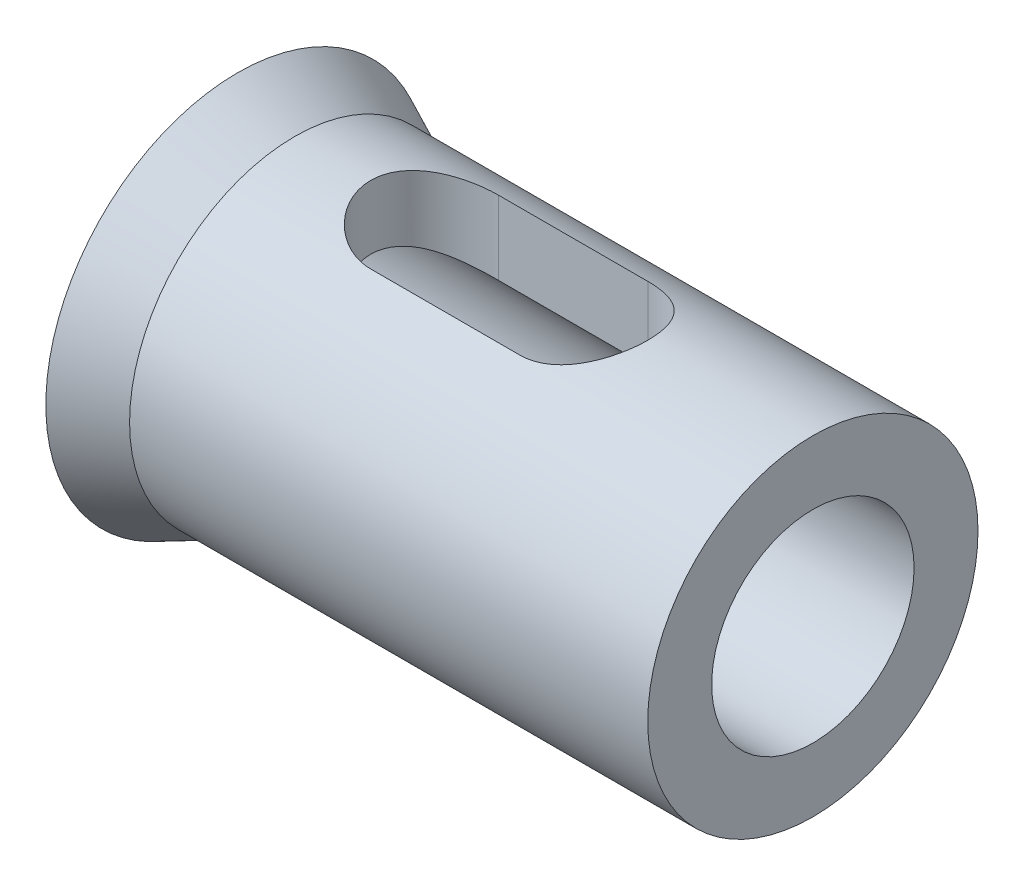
ISO-10303-21;
HEADER;
FILE_DESCRIPTION(('STEP AP214'),'2;1');
FILE_NAME('part.step','',(''),(''),'','','');
FILE_SCHEMA(('AUTOMOTIVE_DESIGN { 1 0 10303 214 1 1 1 1 }'));
ENDSEC;
DATA;
#1=APPLICATION_CONTEXT('core data for automotive mechanical design processes');
#2=APPLICATION_PROTOCOL_DEFINITION('international standard','automotive_design',2000,#1);
#3=PRODUCT_CONTEXT('',#1,'mechanical');
#4=PRODUCT('Part','Part','',(#3));
#5=PRODUCT_RELATED_PRODUCT_CATEGORY('part','',(#4));
#6=PRODUCT_DEFINITION_FORMATION('','',#4);
#7=PRODUCT_DEFINITION_CONTEXT('part definition',#1,'design');
#8=PRODUCT_DEFINITION('design','',#6,#7);
#9=PRODUCT_DEFINITION_SHAPE('','',#8);
#10=(LENGTH_UNIT() NAMED_UNIT(*) SI_UNIT(.MILLI.,.METRE.));
#11=(NAMED_UNIT(*) PLANE_ANGLE_UNIT() SI_UNIT($,.RADIAN.));
#12=(NAMED_UNIT(*) SI_UNIT($,.STERADIAN.) SOLID_ANGLE_UNIT());
#13=UNCERTAINTY_MEASURE_WITH_UNIT(LENGTH_MEASURE(1.E-05),#10,'distance_accuracy_value','');
#14=(GEOMETRIC_REPRESENTATION_CONTEXT(3) GLOBAL_UNCERTAINTY_ASSIGNED_CONTEXT((#13)) GLOBAL_UNIT_ASSIGNED_CONTEXT((#10,
#11,#12)) REPRESENTATION_CONTEXT('',''));
#15=CARTESIAN_POINT('',(0.,0.,0.));
#16=DIRECTION('',(0.,0.,1.));
#17=DIRECTION('',(1.,0.,0.));
#18=AXIS2_PLACEMENT_3D('',#15,#16,#17);
#19=CARTESIAN_POINT('',(0.,0.,0.));
#20=DIRECTION('',(-1.,0.,0.));
#21=DIRECTION('',(0.,-1.,0.));
#22=AXIS2_PLACEMENT_3D('',#19,#20,#21);
#23=PLANE('',#22);
#24=CARTESIAN_POINT('',(0.,0.,0.));
#25=DIRECTION('',(1.,0.,0.));
#26=DIRECTION('',(0.,0.,-1.));
#27=AXIS2_PLACEMENT_3D('',#24,#25,#26);
#28=CIRCLE('',#27,4.74999999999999);
#29=CARTESIAN_POINT('',(0.,0.,-4.74999999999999));
#30=VERTEX_POINT('',#29);
#31=EDGE_CURVE('E211',#30,#30,#28,.T.);
#32=ORIENTED_EDGE('',*,*,#31,.T.);
#33=EDGE_LOOP('',(#32));
#34=FACE_BOUND('',#33,.T.);
#35=CARTESIAN_POINT('',(0.,0.,0.));
#36=DIRECTION('',(1.,0.,0.));
#37=DIRECTION('',(0.,1.,0.));
#38=AXIS2_PLACEMENT_3D('',#35,#36,#37);
#39=CIRCLE('',#38,9.);
#40=CARTESIAN_POINT('',(0.,9.,0.));
#41=VERTEX_POINT('',#40);
#42=EDGE_CURVE('E201',#41,#41,#39,.T.);
#43=ORIENTED_EDGE('',*,*,#42,.F.);
#44=EDGE_LOOP('',(#43));
#45=FACE_BOUND('',#44,.T.);
#46=ADVANCED_FACE('F32',(#34,#45),#23,.T.);
#47=CARTESIAN_POINT('',(2.68063365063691,0.,0.));
#48=DIRECTION('',(-1.,0.,0.));
#49=DIRECTION('',(0.,-1.,0.));
#50=AXIS2_PLACEMENT_3D('',#47,#48,#49);
#51=CONICAL_SURFACE('',#50,7.75,0.436332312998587);
#52=ORIENTED_EDGE('',*,*,#42,.T.);
#53=EDGE_LOOP('',(#52));
#54=FACE_BOUND('',#53,.T.);
#55=CARTESIAN_POINT('',(2.68063365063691,0.,0.));
#56=DIRECTION('',(1.,0.,0.));
#57=DIRECTION('',(0.,1.,0.));
#58=AXIS2_PLACEMENT_3D('',#55,#56,#57);
#59=CIRCLE('',#58,7.75);
#60=CARTESIAN_POINT('',(2.68063365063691,7.75,0.));
#61=VERTEX_POINT('',#60);
#62=EDGE_CURVE('E203',#61,#61,#59,.T.);
#63=ORIENTED_EDGE('',*,*,#62,.F.);
#64=EDGE_LOOP('',(#63));
#65=FACE_BOUND('',#64,.T.);
#66=ADVANCED_FACE('F165',(#54,#65),#51,.T.);
#67=CARTESIAN_POINT('',(27.,0.,0.));
#68=DIRECTION('',(1.,0.,0.));
#69=DIRECTION('',(0.,1.,0.));
#70=AXIS2_PLACEMENT_3D('',#67,#68,#69);
#71=CYLINDRICAL_SURFACE('',#70,7.75);
#72=CARTESIAN_POINT('',(9.25,-7.14580296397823,3.));
#73=CARTESIAN_POINT('',(9.1690530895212,-7.14578711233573,3.00001172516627));
#74=CARTESIAN_POINT('',(9.08811485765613,-7.14717801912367,2.99672410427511));
#75=CARTESIAN_POINT('',(8.92688588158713,-7.15265499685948,2.98364174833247));
#76=CARTESIAN_POINT('',(8.84659491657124,-7.15674010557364,2.97384933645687));
#77=CARTESIAN_POINT('',(8.68752889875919,-7.16746726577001,2.94789730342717));
#78=CARTESIAN_POINT('',(8.60874931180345,-7.17409973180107,2.93176154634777));
#79=CARTESIAN_POINT('',(8.45297045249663,-7.18969677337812,2.89330068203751));
#80=CARTESIAN_POINT('',(8.37597127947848,-7.19866147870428,2.87097523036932));
#81=CARTESIAN_POINT('',(8.14857383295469,-7.2286349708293,2.79505390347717));
#82=CARTESIAN_POINT('',(8.00147634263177,-7.25274494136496,2.73246350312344));
#83=CARTESIAN_POINT('',(7.71981506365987,-7.3064865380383,2.58531598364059));
#84=CARTESIAN_POINT('',(7.58526246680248,-7.33612302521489,2.50073949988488));
#85=CARTESIAN_POINT('',(7.32538976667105,-7.39932344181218,2.30723702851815));
#86=CARTESIAN_POINT('',(7.2008220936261,-7.43300756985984,2.19733767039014));
#87=CARTESIAN_POINT('',(6.97135670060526,-7.49950850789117,1.95837690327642));
#88=CARTESIAN_POINT('',(6.86646289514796,-7.5323251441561,1.82931168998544));
#89=CARTESIAN_POINT('',(6.67558884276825,-7.59484377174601,1.5498575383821));
#90=CARTESIAN_POINT('',(6.59044201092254,-7.62438766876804,1.39886074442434));
#91=CARTESIAN_POINT('',(6.44707985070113,-7.67556878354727,1.08334243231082));
#92=CARTESIAN_POINT('',(6.38885391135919,-7.69720911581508,0.918826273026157));
#93=CARTESIAN_POINT('',(6.30366784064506,-7.72928758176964,0.588907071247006));
#94=CARTESIAN_POINT('',(6.2754014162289,-7.74019212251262,0.423887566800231));
#95=CARTESIAN_POINT('',(6.24674115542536,-7.75125001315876,0.0911081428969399));
#96=CARTESIAN_POINT('',(6.24633812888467,-7.75140690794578,-0.076650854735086));
#97=CARTESIAN_POINT('',(6.27267781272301,-7.74124192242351,-0.400742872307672));
#98=CARTESIAN_POINT('',(6.29799203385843,-7.7314714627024,-0.557212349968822));
#99=CARTESIAN_POINT('',(6.37263118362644,-7.70328262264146,-0.863479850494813));
#100=CARTESIAN_POINT('',(6.42195747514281,-7.68486375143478,-1.01327749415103));
#101=CARTESIAN_POINT('',(6.54383530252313,-7.6408482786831,-1.30460000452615));
#102=CARTESIAN_POINT('',(6.6167206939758,-7.61514919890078,-1.44596908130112));
#103=CARTESIAN_POINT('',(6.78334238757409,-7.55915001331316,-1.71482883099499));
#104=CARTESIAN_POINT('',(6.87708574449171,-7.5288483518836,-1.84231478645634));
#105=CARTESIAN_POINT('',(7.08954283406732,-7.46453092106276,-2.08816065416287));
#106=CARTESIAN_POINT('',(7.20944268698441,-7.43040135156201,-2.20546785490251));
#107=CARTESIAN_POINT('',(7.46737036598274,-7.36374473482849,-2.41873387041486));
#108=CARTESIAN_POINT('',(7.60540578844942,-7.33121836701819,-2.51468369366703));
#109=CARTESIAN_POINT('',(7.90031277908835,-7.27068953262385,-2.68476755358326));
#110=CARTESIAN_POINT('',(8.05757496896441,-7.24282360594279,-2.7582827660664));
#111=CARTESIAN_POINT('',(8.30181386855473,-7.20798301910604,-2.84753967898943));
#112=CARTESIAN_POINT('',(8.38459801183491,-7.19753079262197,-2.87378575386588));
#113=CARTESIAN_POINT('',(8.55239360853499,-7.17929066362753,-2.91905507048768));
#114=CARTESIAN_POINT('',(8.63740404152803,-7.17150156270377,-2.93808156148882));
#115=CARTESIAN_POINT('',(8.80996165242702,-7.15881729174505,-2.96886028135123));
#116=CARTESIAN_POINT('',(8.89752678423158,-7.15395655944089,-2.98052602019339));
#117=CARTESIAN_POINT('',(9.07339093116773,-7.1474394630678,-2.99610111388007));
#118=CARTESIAN_POINT('',(9.1616893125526,-7.14578057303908,-3.0000165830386));
#119=CARTESIAN_POINT('',(9.25,-7.14580296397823,-3.));
#120=B_SPLINE_CURVE_WITH_KNOTS('',3,(#72,#73,#74,#75,#76,#77,#78,#79,#80,#81,#82,#83,#84,#85,
#86,#87,#88,#89,#90,#91,#92,#93,#94,#95,#96,#97,#98,#99,#100,#101,#102,#103,#104,#105,#106,#107,
#108,#109,#110,#111,#112,#113,#114,#115,#116,#117,#118,#119),.UNSPECIFIED.,.F.,.F.,(4,2,2,2,2,2,
2,2,2,2,2,2,2,2,2,2,2,2,2,2,2,2,2,4),(0.,0.242747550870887,0.485408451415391,0.727165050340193,
0.968935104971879,1.45157424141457,1.93463991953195,2.44087663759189,2.9472139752,
3.4720959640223,3.99677089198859,4.49748738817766,4.99803873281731,5.47222896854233,
5.94644612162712,6.4277018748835,6.90912065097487,7.420326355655,7.93174687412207,
8.45621110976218,8.71832413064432,8.9803190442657,9.24533776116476,9.51014731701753),.UNSPECIFIED.);
#121=CARTESIAN_POINT('',(9.25,-7.14580296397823,3.));
#122=VERTEX_POINT('',#121);
#123=CARTESIAN_POINT('',(9.25,-7.14580296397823,-3.));
#124=VERTEX_POINT('',#123);
#125=EDGE_CURVE('E177',#122,#124,#120,.T.);
#126=ORIENTED_EDGE('',*,*,#125,.F.);
#127=DIRECTION('',(1.,0.,0.));
#128=VECTOR('',#127,1.);
#129=CARTESIAN_POINT('',(27.,-7.14580296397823,3.));
#130=LINE('',#129,#128);
#131=CARTESIAN_POINT('',(16.25,-7.14580296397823,3.));
#132=VERTEX_POINT('',#131);
#133=EDGE_CURVE('E155',#132,#122,#130,.F.);
#134=ORIENTED_EDGE('',*,*,#133,.F.);
#135=CARTESIAN_POINT('',(16.25,-7.14580296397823,-3.));
#136=CARTESIAN_POINT('',(16.3309469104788,-7.14578711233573,-3.00001172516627));
#137=CARTESIAN_POINT('',(16.4118851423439,-7.14717801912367,-2.99672410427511));
#138=CARTESIAN_POINT('',(16.5731141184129,-7.15265499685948,-2.98364174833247));
#139=CARTESIAN_POINT('',(16.6534050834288,-7.15674010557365,-2.97384933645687));
#140=CARTESIAN_POINT('',(16.8124711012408,-7.16746726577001,-2.94789730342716));
#141=CARTESIAN_POINT('',(16.8912506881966,-7.17409973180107,-2.93176154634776));
#142=CARTESIAN_POINT('',(17.0470295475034,-7.18969677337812,-2.89330068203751));
#143=CARTESIAN_POINT('',(17.1240287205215,-7.19866147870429,-2.87097523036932));
#144=CARTESIAN_POINT('',(17.3514261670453,-7.22863497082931,-2.79505390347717));
#145=CARTESIAN_POINT('',(17.4985236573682,-7.25274494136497,-2.73246350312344));
#146=CARTESIAN_POINT('',(17.7801849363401,-7.3064865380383,-2.58531598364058));
#147=CARTESIAN_POINT('',(17.9147375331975,-7.3361230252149,-2.50073949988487));
#148=CARTESIAN_POINT('',(18.1746102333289,-7.39932344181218,-2.30723702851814));
#149=CARTESIAN_POINT('',(18.2991779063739,-7.43300756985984,-2.19733767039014));
#150=CARTESIAN_POINT('',(18.5286432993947,-7.49950850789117,-1.95837690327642));
#151=CARTESIAN_POINT('',(18.633537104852,-7.5323251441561,-1.82931168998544));
#152=CARTESIAN_POINT('',(18.8244111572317,-7.59484377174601,-1.5498575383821));
#153=CARTESIAN_POINT('',(18.9095579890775,-7.62438766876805,-1.39886074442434));
#154=CARTESIAN_POINT('',(19.0529201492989,-7.67556878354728,-1.08334243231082));
#155=CARTESIAN_POINT('',(19.1111460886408,-7.69720911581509,-0.918826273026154));
#156=CARTESIAN_POINT('',(19.1963321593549,-7.72928758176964,-0.588907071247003));
#157=CARTESIAN_POINT('',(19.2245985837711,-7.74019212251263,-0.423887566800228));
#158=CARTESIAN_POINT('',(19.2532588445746,-7.75125001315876,-0.0911081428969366));
#159=CARTESIAN_POINT('',(19.2536618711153,-7.75140690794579,0.0766508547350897));
#160=CARTESIAN_POINT('',(19.227322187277,-7.74124192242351,0.400742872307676));
#161=CARTESIAN_POINT('',(19.2020079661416,-7.73147146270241,0.557212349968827));
#162=CARTESIAN_POINT('',(19.1273688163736,-7.70328262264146,0.863479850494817));
#163=CARTESIAN_POINT('',(19.0780425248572,-7.68486375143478,1.01327749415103));
#164=CARTESIAN_POINT('',(18.9561646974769,-7.6408482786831,1.30460000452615));
#165=CARTESIAN_POINT('',(18.8832793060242,-7.61514919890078,1.44596908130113));
#166=CARTESIAN_POINT('',(18.7166576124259,-7.55915001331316,1.71482883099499));
#167=CARTESIAN_POINT('',(18.6229142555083,-7.5288483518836,1.84231478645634));
#168=CARTESIAN_POINT('',(18.4104571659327,-7.46453092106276,2.08816065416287));
#169=CARTESIAN_POINT('',(18.2905573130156,-7.43040135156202,2.20546785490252));
#170=CARTESIAN_POINT('',(18.0326296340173,-7.36374473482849,2.41873387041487));
#171=CARTESIAN_POINT('',(17.8945942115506,-7.33121836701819,2.51468369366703));
#172=CARTESIAN_POINT('',(17.5996872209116,-7.27068953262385,2.68476755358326));
#173=CARTESIAN_POINT('',(17.4424250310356,-7.24282360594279,2.7582827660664));
#174=CARTESIAN_POINT('',(17.1981861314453,-7.20798301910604,2.84753967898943));
#175=CARTESIAN_POINT('',(17.1154019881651,-7.19753079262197,2.87378575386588));
#176=CARTESIAN_POINT('',(16.947606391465,-7.17929066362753,2.91905507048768));
#177=CARTESIAN_POINT('',(16.862595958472,-7.17150156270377,2.93808156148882));
#178=CARTESIAN_POINT('',(16.690038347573,-7.15881729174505,2.96886028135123));
#179=CARTESIAN_POINT('',(16.6024732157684,-7.15395655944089,2.98052602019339));
#180=CARTESIAN_POINT('',(16.4266090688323,-7.1474394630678,2.99610111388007));
#181=CARTESIAN_POINT('',(16.3383106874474,-7.14578057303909,3.0000165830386));
#182=CARTESIAN_POINT('',(16.25,-7.14580296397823,3.));
#183=B_SPLINE_CURVE_WITH_KNOTS('',3,(#135,#136,#137,#138,#139,#140,#141,#142,#143,#144,#145,
#146,#147,#148,#149,#150,#151,#152,#153,#154,#155,#156,#157,#158,#159,#160,#161,#162,#163,#164,
#165,#166,#167,#168,#169,#170,#171,#172,#173,#174,#175,#176,#177,#178,#179,#180,#181,#182),
.UNSPECIFIED.,.F.,.F.,(4,2,2,2,2,2,2,2,2,2,2,2,2,2,2,2,2,2,2,2,2,2,2,4),(0.,0.242747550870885,
0.485408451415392,0.727165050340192,0.968935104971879,1.45157424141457,1.93463991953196,
2.44087663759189,2.94721397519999,3.47209596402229,3.99677089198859,4.49748738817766,
4.99803873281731,5.47222896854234,5.94644612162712,6.4277018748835,6.90912065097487,
7.42032635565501,7.93174687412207,8.45621110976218,8.71832413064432,8.9803190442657,
9.24533776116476,9.51014731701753),.UNSPECIFIED.);
#184=CARTESIAN_POINT('',(16.25,-7.14580296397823,-3.));
#185=VERTEX_POINT('',#184);
#186=EDGE_CURVE('E114',#185,#132,#183,.T.);
#187=ORIENTED_EDGE('',*,*,#186,.F.);
#188=DIRECTION('',(1.,0.,0.));
#189=VECTOR('',#188,1.);
#190=CARTESIAN_POINT('',(27.,-7.14580296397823,-3.));
#191=LINE('',#190,#189);
#192=EDGE_CURVE('E223',#124,#185,#191,.T.);
#193=ORIENTED_EDGE('',*,*,#192,.F.);
#194=EDGE_LOOP('',(#126,#134,#187,#193));
#195=FACE_BOUND('',#194,.T.);
#196=CARTESIAN_POINT('',(9.25,7.14580296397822,-3.));
#197=CARTESIAN_POINT('',(9.1690530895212,7.14578711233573,-3.00001172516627));
#198=CARTESIAN_POINT('',(9.08811485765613,7.14717801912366,-2.99672410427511));
#199=CARTESIAN_POINT('',(8.92688588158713,7.15265499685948,-2.98364174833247));
#200=CARTESIAN_POINT('',(8.84659491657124,7.15674010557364,-2.97384933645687));
#201=CARTESIAN_POINT('',(8.68752889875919,7.16746726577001,-2.94789730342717));
#202=CARTESIAN_POINT('',(8.60874931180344,7.17409973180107,-2.93176154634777));
#203=CARTESIAN_POINT('',(8.45297045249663,7.18969677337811,-2.89330068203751));
#204=CARTESIAN_POINT('',(8.37597127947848,7.19866147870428,-2.87097523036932));
#205=CARTESIAN_POINT('',(8.14857383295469,7.2286349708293,-2.79505390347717));
#206=CARTESIAN_POINT('',(8.00147634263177,7.25274494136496,-2.73246350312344));
#207=CARTESIAN_POINT('',(7.71981506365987,7.3064865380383,-2.58531598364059));
#208=CARTESIAN_POINT('',(7.58526246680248,7.33612302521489,-2.50073949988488));
#209=CARTESIAN_POINT('',(7.32538976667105,7.39932344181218,-2.30723702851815));
#210=CARTESIAN_POINT('',(7.2008220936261,7.43300756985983,-2.19733767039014));
#211=CARTESIAN_POINT('',(6.97135670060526,7.49950850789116,-1.95837690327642));
#212=CARTESIAN_POINT('',(6.86646289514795,7.5323251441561,-1.82931168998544));
#213=CARTESIAN_POINT('',(6.67558884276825,7.59484377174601,-1.5498575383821));
#214=CARTESIAN_POINT('',(6.59044201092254,7.62438766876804,-1.39886074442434));
#215=CARTESIAN_POINT('',(6.44707985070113,7.67556878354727,-1.08334243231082));
#216=CARTESIAN_POINT('',(6.38885391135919,7.69720911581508,-0.918826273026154));
#217=CARTESIAN_POINT('',(6.30366784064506,7.72928758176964,-0.588907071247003));
#218=CARTESIAN_POINT('',(6.2754014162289,7.74019212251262,-0.423887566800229));
#219=CARTESIAN_POINT('',(6.24674115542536,7.75125001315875,-0.0911081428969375));
#220=CARTESIAN_POINT('',(6.24633812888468,7.75140690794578,0.0766508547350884));
#221=CARTESIAN_POINT('',(6.27267781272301,7.74124192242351,0.400742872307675));
#222=CARTESIAN_POINT('',(6.29799203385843,7.7314714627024,0.557212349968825));
#223=CARTESIAN_POINT('',(6.37263118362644,7.70328262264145,0.863479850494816));
#224=CARTESIAN_POINT('',(6.42195747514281,7.68486375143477,1.01327749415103));
#225=CARTESIAN_POINT('',(6.54383530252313,7.6408482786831,1.30460000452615));
#226=CARTESIAN_POINT('',(6.6167206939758,7.61514919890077,1.44596908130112));
#227=CARTESIAN_POINT('',(6.78334238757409,7.55915001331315,1.71482883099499));
#228=CARTESIAN_POINT('',(6.87708574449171,7.5288483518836,1.84231478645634));
#229=CARTESIAN_POINT('',(7.08954283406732,7.46453092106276,2.08816065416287));
#230=CARTESIAN_POINT('',(7.20944268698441,7.43040135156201,2.20546785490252));
#231=CARTESIAN_POINT('',(7.46737036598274,7.36374473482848,2.41873387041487));
#232=CARTESIAN_POINT('',(7.60540578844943,7.33121836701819,2.51468369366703));
#233=CARTESIAN_POINT('',(7.90031277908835,7.27068953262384,2.68476755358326));
#234=CARTESIAN_POINT('',(8.05757496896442,7.24282360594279,2.7582827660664));
#235=CARTESIAN_POINT('',(8.30181386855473,7.20798301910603,2.84753967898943));
#236=CARTESIAN_POINT('',(8.38459801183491,7.19753079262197,2.87378575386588));
#237=CARTESIAN_POINT('',(8.552393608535,7.17929066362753,2.91905507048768));
#238=CARTESIAN_POINT('',(8.63740404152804,7.17150156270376,2.93808156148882));
#239=CARTESIAN_POINT('',(8.80996165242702,7.15881729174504,2.96886028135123));
#240=CARTESIAN_POINT('',(8.89752678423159,7.15395655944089,2.98052602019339));
#241=CARTESIAN_POINT('',(9.07339093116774,7.1474394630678,2.99610111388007));
#242=CARTESIAN_POINT('',(9.1616893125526,7.14578057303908,3.0000165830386));
#243=CARTESIAN_POINT('',(9.25,7.14580296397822,3.));
#244=B_SPLINE_CURVE_WITH_KNOTS('',3,(#196,#197,#198,#199,#200,#201,#202,#203,#204,#205,#206,
#207,#208,#209,#210,#211,#212,#213,#214,#215,#216,#217,#218,#219,#220,#221,#222,#223,#224,#225,
#226,#227,#228,#229,#230,#231,#232,#233,#234,#235,#236,#237,#238,#239,#240,#241,#242,#243),
.UNSPECIFIED.,.F.,.F.,(4,2,2,2,2,2,2,2,2,2,2,2,2,2,2,2,2,2,2,2,2,2,2,4),(0.,0.242747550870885,
0.485408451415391,0.727165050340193,0.968935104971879,1.45157424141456,1.93463991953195,
2.44087663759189,2.9472139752,3.4720959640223,3.99677089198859,4.49748738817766,
4.99803873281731,5.47222896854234,5.94644612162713,6.4277018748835,6.90912065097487,
7.420326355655,7.93174687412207,8.45621110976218,8.71832413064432,8.9803190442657,
9.24533776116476,9.51014731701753),.UNSPECIFIED.);
#245=CARTESIAN_POINT('',(9.25,7.14580296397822,-3.));
#246=VERTEX_POINT('',#245);
#247=CARTESIAN_POINT('',(9.25,7.14580296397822,3.));
#248=VERTEX_POINT('',#247);
#249=EDGE_CURVE('E172',#246,#248,#244,.T.);
#250=ORIENTED_EDGE('',*,*,#249,.F.);
#251=DIRECTION('',(1.,0.,0.));
#252=VECTOR('',#251,1.);
#253=CARTESIAN_POINT('',(27.,7.14580296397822,-3.));
#254=LINE('',#253,#252);
#255=CARTESIAN_POINT('',(16.25,7.14580296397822,-3.));
#256=VERTEX_POINT('',#255);
#257=EDGE_CURVE('E178',#256,#246,#254,.F.);
#258=ORIENTED_EDGE('',*,*,#257,.F.);
#259=CARTESIAN_POINT('',(16.25,7.14580296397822,3.));
#260=CARTESIAN_POINT('',(16.3309469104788,7.14578711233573,3.00001172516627));
#261=CARTESIAN_POINT('',(16.4118851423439,7.14717801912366,2.99672410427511));
#262=CARTESIAN_POINT('',(16.5731141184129,7.15265499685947,2.98364174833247));
#263=CARTESIAN_POINT('',(16.6534050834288,7.15674010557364,2.97384933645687));
#264=CARTESIAN_POINT('',(16.8124711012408,7.16746726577,2.94789730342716));
#265=CARTESIAN_POINT('',(16.8912506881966,7.17409973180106,2.93176154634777));
#266=CARTESIAN_POINT('',(17.0470295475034,7.18969677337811,2.89330068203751));
#267=CARTESIAN_POINT('',(17.1240287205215,7.19866147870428,2.87097523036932));
#268=CARTESIAN_POINT('',(17.3514261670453,7.2286349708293,2.79505390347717));
#269=CARTESIAN_POINT('',(17.4985236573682,7.25274494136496,2.73246350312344));
#270=CARTESIAN_POINT('',(17.7801849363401,7.30648653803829,2.58531598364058));
#271=CARTESIAN_POINT('',(17.9147375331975,7.33612302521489,2.50073949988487));
#272=CARTESIAN_POINT('',(18.1746102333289,7.39932344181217,2.30723702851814));
#273=CARTESIAN_POINT('',(18.2991779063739,7.43300756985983,2.19733767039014));
#274=CARTESIAN_POINT('',(18.5286432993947,7.49950850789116,1.95837690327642));
#275=CARTESIAN_POINT('',(18.633537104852,7.53232514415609,1.82931168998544));
#276=CARTESIAN_POINT('',(18.8244111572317,7.594843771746,1.5498575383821));
#277=CARTESIAN_POINT('',(18.9095579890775,7.62438766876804,1.39886074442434));
#278=CARTESIAN_POINT('',(19.0529201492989,7.67556878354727,1.08334243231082));
#279=CARTESIAN_POINT('',(19.1111460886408,7.69720911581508,0.918826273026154));
#280=CARTESIAN_POINT('',(19.1963321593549,7.72928758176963,0.588907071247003));
#281=CARTESIAN_POINT('',(19.2245985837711,7.74019212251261,0.423887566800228));
#282=CARTESIAN_POINT('',(19.2532588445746,7.75125001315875,0.0911081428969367));
#283=CARTESIAN_POINT('',(19.2536618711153,7.75140690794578,-0.0766508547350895));
#284=CARTESIAN_POINT('',(19.227322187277,7.7412419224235,-0.400742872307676));
#285=CARTESIAN_POINT('',(19.2020079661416,7.73147146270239,-0.557212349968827));
#286=CARTESIAN_POINT('',(19.1273688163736,7.70328262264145,-0.863479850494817));
#287=CARTESIAN_POINT('',(19.0780425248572,7.68486375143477,-1.01327749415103));
#288=CARTESIAN_POINT('',(18.9561646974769,7.64084827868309,-1.30460000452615));
#289=CARTESIAN_POINT('',(18.8832793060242,7.61514919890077,-1.44596908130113));
#290=CARTESIAN_POINT('',(18.7166576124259,7.55915001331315,-1.71482883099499));
#291=CARTESIAN_POINT('',(18.6229142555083,7.52884835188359,-1.84231478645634));
#292=CARTESIAN_POINT('',(18.4104571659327,7.46453092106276,-2.08816065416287));
#293=CARTESIAN_POINT('',(18.2905573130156,7.43040135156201,-2.20546785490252));
#294=CARTESIAN_POINT('',(18.0326296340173,7.36374473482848,-2.41873387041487));
#295=CARTESIAN_POINT('',(17.8945942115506,7.33121836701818,-2.51468369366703));
#296=CARTESIAN_POINT('',(17.5996872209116,7.27068953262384,-2.68476755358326));
#297=CARTESIAN_POINT('',(17.4424250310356,7.24282360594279,-2.7582827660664));
#298=CARTESIAN_POINT('',(17.1981861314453,7.20798301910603,-2.84753967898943));
#299=CARTESIAN_POINT('',(17.1154019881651,7.19753079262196,-2.87378575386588));
#300=CARTESIAN_POINT('',(16.947606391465,7.17929066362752,-2.91905507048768));
#301=CARTESIAN_POINT('',(16.862595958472,7.17150156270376,-2.93808156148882));
#302=CARTESIAN_POINT('',(16.690038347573,7.15881729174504,-2.96886028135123));
#303=CARTESIAN_POINT('',(16.6024732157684,7.15395655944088,-2.98052602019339));
#304=CARTESIAN_POINT('',(16.4266090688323,7.14743946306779,-2.99610111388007));
#305=CARTESIAN_POINT('',(16.3383106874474,7.14578057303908,-3.0000165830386));
#306=CARTESIAN_POINT('',(16.25,7.14580296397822,-3.));
#307=B_SPLINE_CURVE_WITH_KNOTS('',3,(#259,#260,#261,#262,#263,#264,#265,#266,#267,#268,#269,
#270,#271,#272,#273,#274,#275,#276,#277,#278,#279,#280,#281,#282,#283,#284,#285,#286,#287,#288,
#289,#290,#291,#292,#293,#294,#295,#296,#297,#298,#299,#300,#301,#302,#303,#304,#305,#306),
.UNSPECIFIED.,.F.,.F.,(4,2,2,2,2,2,2,2,2,2,2,2,2,2,2,2,2,2,2,2,2,2,2,4),(0.,0.242747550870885,
0.485408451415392,0.727165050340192,0.968935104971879,1.45157424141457,1.93463991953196,
2.44087663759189,2.94721397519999,3.47209596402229,3.99677089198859,4.49748738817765,
4.99803873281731,5.47222896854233,5.94644612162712,6.42770187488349,6.90912065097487,
7.42032635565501,7.93174687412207,8.45621110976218,8.71832413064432,8.9803190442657,
9.24533776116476,9.51014731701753),.UNSPECIFIED.);
#308=CARTESIAN_POINT('',(16.25,7.14580296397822,3.));
#309=VERTEX_POINT('',#308);
#310=EDGE_CURVE('E149',#309,#256,#307,.T.);
#311=ORIENTED_EDGE('',*,*,#310,.F.);
#312=DIRECTION('',(1.,0.,0.));
#313=VECTOR('',#312,1.);
#314=CARTESIAN_POINT('',(27.,7.14580296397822,3.));
#315=LINE('',#314,#313);
#316=EDGE_CURVE('E224',#248,#309,#315,.T.);
#317=ORIENTED_EDGE('',*,*,#316,.F.);
#318=EDGE_LOOP('',(#250,#258,#311,#317));
#319=FACE_BOUND('',#318,.T.);
#320=ORIENTED_EDGE('',*,*,#62,.T.);
#321=EDGE_LOOP('',(#320));
#322=FACE_BOUND('',#321,.T.);
#323=CARTESIAN_POINT('',(27.,0.,0.));
#324=DIRECTION('',(1.,0.,0.));
#325=DIRECTION('',(0.,1.,0.));
#326=AXIS2_PLACEMENT_3D('',#323,#324,#325);
#327=CIRCLE('',#326,7.75);
#328=CARTESIAN_POINT('',(27.,7.74999999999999,0.));
#329=VERTEX_POINT('',#328);
#330=EDGE_CURVE('E208',#329,#329,#327,.T.);
#331=ORIENTED_EDGE('',*,*,#330,.F.);
#332=EDGE_LOOP('',(#331));
#333=FACE_BOUND('',#332,.T.);
#334=ADVANCED_FACE('F161',(#195,#319,#322,#333),#71,.T.);
#335=CARTESIAN_POINT('',(27.,7.74999999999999,0.));
#336=DIRECTION('',(1.,0.,0.));
#337=DIRECTION('',(0.,1.,0.));
#338=AXIS2_PLACEMENT_3D('',#335,#336,#337);
#339=PLANE('',#338);
#340=CARTESIAN_POINT('',(27.,0.,0.));
#341=DIRECTION('',(1.,0.,0.));
#342=DIRECTION('',(0.,0.,-1.));
#343=AXIS2_PLACEMENT_3D('',#340,#341,#342);
#344=CIRCLE('',#343,4.74999999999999);
#345=CARTESIAN_POINT('',(27.,0.,-4.74999999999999));
#346=VERTEX_POINT('',#345);
#347=EDGE_CURVE('E213',#346,#346,#344,.T.);
#348=ORIENTED_EDGE('',*,*,#347,.F.);
#349=EDGE_LOOP('',(#348));
#350=FACE_BOUND('',#349,.T.);
#351=ORIENTED_EDGE('',*,*,#330,.T.);
#352=EDGE_LOOP('',(#351));
#353=FACE_BOUND('',#352,.T.);
#354=ADVANCED_FACE('F164',(#350,#353),#339,.T.);
#355=CARTESIAN_POINT('',(27.,0.,0.));
#356=DIRECTION('',(1.,0.,0.));
#357=DIRECTION('',(0.,0.,-1.));
#358=AXIS2_PLACEMENT_3D('',#355,#356,#357);
#359=CYLINDRICAL_SURFACE('',#358,4.74999999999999);
#360=DIRECTION('',(1.,0.,0.));
#361=VECTOR('',#360,1.);
#362=CARTESIAN_POINT('',(27.,-3.68272996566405,3.));
#363=LINE('',#362,#361);
#364=CARTESIAN_POINT('',(16.25,-3.68272996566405,3.));
#365=VERTEX_POINT('',#364);
#366=CARTESIAN_POINT('',(9.25,-3.68272996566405,3.));
#367=VERTEX_POINT('',#366);
#368=EDGE_CURVE('E99',#365,#367,#363,.F.);
#369=ORIENTED_EDGE('',*,*,#368,.T.);
#370=CARTESIAN_POINT('',(9.25,-3.68272996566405,3.));
#371=CARTESIAN_POINT('',(9.175100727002,-3.68269415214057,3.00001795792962));
#372=CARTESIAN_POINT('',(9.10022302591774,-3.68501397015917,2.9971958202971));
#373=CARTESIAN_POINT('',(8.95123516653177,-3.6940909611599,2.98601488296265));
#374=CARTESIAN_POINT('',(8.87712423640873,-3.70084311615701,2.97766234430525));
#375=CARTESIAN_POINT('',(8.73087170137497,-3.7184338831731,2.95566126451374));
#376=CARTESIAN_POINT('',(8.65871847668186,-3.72923582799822,2.94206021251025));
#377=CARTESIAN_POINT('',(8.51620781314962,-3.7544678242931,2.90979245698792));
#378=CARTESIAN_POINT('',(8.44585080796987,-3.76889874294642,2.8911245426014));
#379=CARTESIAN_POINT('',(8.23871299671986,-3.81670499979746,2.82808037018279));
#380=CARTESIAN_POINT('',(8.10510650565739,-3.85469461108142,2.77654572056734));
#381=CARTESIAN_POINT('',(7.84835987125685,-3.93856100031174,2.65624057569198));
#382=CARTESIAN_POINT('',(7.72524726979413,-3.98445763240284,2.58742648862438));
#383=CARTESIAN_POINT('',(7.47479940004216,-4.08644565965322,2.42362789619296));
#384=CARTESIAN_POINT('',(7.34917405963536,-4.14307407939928,2.32635519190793));
#385=CARTESIAN_POINT('',(7.11463729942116,-4.25578410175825,2.11314717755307));
#386=CARTESIAN_POINT('',(7.00573234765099,-4.31186548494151,1.99720468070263));
#387=CARTESIAN_POINT('',(6.79414410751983,-4.42547108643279,1.73230054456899));
#388=CARTESIAN_POINT('',(6.6939203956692,-4.4823068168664,1.58102554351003));
#389=CARTESIAN_POINT('',(6.56440516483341,-4.55781890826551,1.34012105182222));
#390=CARTESIAN_POINT('',(6.52469411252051,-4.58137199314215,1.25745888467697));
#391=CARTESIAN_POINT('',(6.45272711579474,-4.62454329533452,1.08798856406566));
#392=CARTESIAN_POINT('',(6.42046595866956,-4.64416426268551,1.00118336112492));
#393=CARTESIAN_POINT('',(6.36683102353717,-4.67704649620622,0.833241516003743));
#394=CARTESIAN_POINT('',(6.34467879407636,-4.6907542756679,0.752439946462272));
#395=CARTESIAN_POINT('',(6.30713995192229,-4.71409681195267,0.588744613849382));
#396=CARTESIAN_POINT('',(6.29174939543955,-4.72373394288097,0.505852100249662));
#397=CARTESIAN_POINT('',(6.26799051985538,-4.73864894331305,0.33872479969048));
#398=CARTESIAN_POINT('',(6.259617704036,-4.74392960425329,0.254490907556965));
#399=CARTESIAN_POINT('',(6.25002202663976,-4.74998508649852,0.0854853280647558));
#400=CARTESIAN_POINT('',(6.24879831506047,-4.75076044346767,0.000713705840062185));
#401=CARTESIAN_POINT('',(6.25527267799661,-4.74666756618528,-0.229936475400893));
#402=CARTESIAN_POINT('',(6.27007192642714,-4.73730672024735,-0.375619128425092));
#403=CARTESIAN_POINT('',(6.32030382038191,-4.70587382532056,-0.661849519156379));
#404=CARTESIAN_POINT('',(6.35573808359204,-4.68380077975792,-0.802396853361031));
#405=CARTESIAN_POINT('',(6.44562098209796,-4.6287986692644,-1.07523238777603));
#406=CARTESIAN_POINT('',(6.50010116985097,-4.59585159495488,-1.20750645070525));
#407=CARTESIAN_POINT('',(6.62602680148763,-4.52163164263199,-1.46110731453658));
#408=CARTESIAN_POINT('',(6.69747495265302,-4.48035743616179,-1.58243236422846));
#409=CARTESIAN_POINT('',(6.8653468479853,-4.38675351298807,-1.82705146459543));
#410=CARTESIAN_POINT('',(6.96377960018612,-4.3336864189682,-1.94868214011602));
#411=CARTESIAN_POINT('',(7.1776882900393,-4.22474814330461,-2.17481127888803));
#412=CARTESIAN_POINT('',(7.29319564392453,-4.16887192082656,-2.27927739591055));
#413=CARTESIAN_POINT('',(7.5562600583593,-4.05160444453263,-2.48244300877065));
#414=CARTESIAN_POINT('',(7.70603907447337,-3.9904913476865,-2.57844472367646));
#415=CARTESIAN_POINT('',(8.02306361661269,-3.87893493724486,-2.74340924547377));
#416=CARTESIAN_POINT('',(8.1902387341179,-3.82845093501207,-2.81247605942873));
#417=CARTESIAN_POINT('',(8.43440447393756,-3.77134154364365,-2.88794369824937));
#418=CARTESIAN_POINT('',(8.50569077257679,-3.75651977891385,-2.90714700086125));
#419=CARTESIAN_POINT('',(8.6501265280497,-3.73059095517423,-2.94034587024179));
#420=CARTESIAN_POINT('',(8.72327523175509,-3.71948241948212,-2.95434350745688));
#421=CARTESIAN_POINT('',(8.87159890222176,-3.70138361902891,-2.97699255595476));
#422=CARTESIAN_POINT('',(8.94678627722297,-3.69443191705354,-2.98559394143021));
#423=CARTESIAN_POINT('',(9.0979739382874,-3.6850831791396,-2.99711086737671));
#424=CARTESIAN_POINT('',(9.17397517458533,-3.68269222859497,-3.00001881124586));
#425=CARTESIAN_POINT('',(9.25,-3.68272996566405,-3.));
#426=B_SPLINE_CURVE_WITH_KNOTS('',3,(#370,#371,#372,#373,#374,#375,#376,#377,#378,#379,#380,
#381,#382,#383,#384,#385,#386,#387,#388,#389,#390,#391,#392,#393,#394,#395,#396,#397,#398,#399,
#400,#401,#402,#403,#404,#405,#406,#407,#408,#409,#410,#411,#412,#413,#414,#415,#416,#417,#418,
#419,#420,#421,#422,#423,#424,#425),.UNSPECIFIED.,.F.,.F.,(4,2,2,2,2,2,2,2,2,2,2,2,2,2,2,2,2,2,
2,2,2,2,2,2,2,2,2,4),(0.,0.224573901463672,0.448893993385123,0.671230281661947,
0.893619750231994,1.33610452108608,1.77971698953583,2.2837685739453,2.78801465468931,
3.35499285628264,3.63866342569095,3.92213490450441,4.17645487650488,4.4306263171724,
4.68463476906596,4.93861301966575,5.37648008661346,5.81438148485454,6.25301179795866,
6.69171214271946,7.18546298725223,7.68013387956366,8.24180915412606,8.80129356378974,
9.02696145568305,9.25253949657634,9.48017899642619,9.70812202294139),.UNSPECIFIED.);
#427=CARTESIAN_POINT('',(9.25,-3.68272996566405,-3.));
#428=VERTEX_POINT('',#427);
#429=EDGE_CURVE('E11',#367,#428,#426,.T.);
#430=ORIENTED_EDGE('',*,*,#429,.T.);
#431=DIRECTION('',(1.,0.,0.));
#432=VECTOR('',#431,1.);
#433=CARTESIAN_POINT('',(27.,-3.68272996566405,-3.));
#434=LINE('',#433,#432);
#435=CARTESIAN_POINT('',(16.25,-3.68272996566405,-3.));
#436=VERTEX_POINT('',#435);
#437=EDGE_CURVE('E44',#428,#436,#434,.T.);
#438=ORIENTED_EDGE('',*,*,#437,.T.);
#439=CARTESIAN_POINT('',(16.25,-3.68272996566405,-3.));
#440=CARTESIAN_POINT('',(16.324899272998,-3.68269415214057,-3.00001795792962));
#441=CARTESIAN_POINT('',(16.3997769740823,-3.68501397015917,-2.9971958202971));
#442=CARTESIAN_POINT('',(16.5487648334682,-3.6940909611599,-2.98601488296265));
#443=CARTESIAN_POINT('',(16.6228757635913,-3.70084311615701,-2.97766234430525));
#444=CARTESIAN_POINT('',(16.769128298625,-3.7184338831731,-2.95566126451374));
#445=CARTESIAN_POINT('',(16.8412815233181,-3.72923582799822,-2.94206021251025));
#446=CARTESIAN_POINT('',(16.9837921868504,-3.7544678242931,-2.90979245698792));
#447=CARTESIAN_POINT('',(17.0541491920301,-3.76889874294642,-2.8911245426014));
#448=CARTESIAN_POINT('',(17.2612870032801,-3.81670499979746,-2.82808037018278));
#449=CARTESIAN_POINT('',(17.3948934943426,-3.85469461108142,-2.77654572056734));
#450=CARTESIAN_POINT('',(17.6516401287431,-3.93856100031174,-2.65624057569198));
#451=CARTESIAN_POINT('',(17.7747527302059,-3.98445763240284,-2.58742648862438));
#452=CARTESIAN_POINT('',(18.0252005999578,-4.08644565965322,-2.42362789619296));
#453=CARTESIAN_POINT('',(18.1508259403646,-4.14307407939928,-2.32635519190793));
#454=CARTESIAN_POINT('',(18.3853627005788,-4.25578410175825,-2.11314717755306));
#455=CARTESIAN_POINT('',(18.494267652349,-4.31186548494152,-1.99720468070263));
#456=CARTESIAN_POINT('',(18.7058558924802,-4.42547108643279,-1.73230054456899));
#457=CARTESIAN_POINT('',(18.8060796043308,-4.4823068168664,-1.58102554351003));
#458=CARTESIAN_POINT('',(18.9355948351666,-4.55781890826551,-1.34012105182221));
#459=CARTESIAN_POINT('',(18.9753058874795,-4.58137199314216,-1.25745888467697));
#460=CARTESIAN_POINT('',(19.0472728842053,-4.62454329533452,-1.08798856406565));
#461=CARTESIAN_POINT('',(19.0795340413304,-4.64416426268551,-1.00118336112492));
#462=CARTESIAN_POINT('',(19.1331689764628,-4.67704649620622,-0.833241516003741));
#463=CARTESIAN_POINT('',(19.1553212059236,-4.6907542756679,-0.75243994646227));
#464=CARTESIAN_POINT('',(19.1928600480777,-4.71409681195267,-0.588744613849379));
#465=CARTESIAN_POINT('',(19.2082506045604,-4.72373394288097,-0.505852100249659));
#466=CARTESIAN_POINT('',(19.2320094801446,-4.73864894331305,-0.338724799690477));
#467=CARTESIAN_POINT('',(19.240382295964,-4.74392960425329,-0.254490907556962));
#468=CARTESIAN_POINT('',(19.2499779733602,-4.74998508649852,-0.085485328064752));
#469=CARTESIAN_POINT('',(19.2512016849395,-4.75076044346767,-0.000713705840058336));
#470=CARTESIAN_POINT('',(19.2447273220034,-4.74666756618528,0.229936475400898));
#471=CARTESIAN_POINT('',(19.2299280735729,-4.73730672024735,0.375619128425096));
#472=CARTESIAN_POINT('',(19.1796961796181,-4.70587382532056,0.661849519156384));
#473=CARTESIAN_POINT('',(19.144261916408,-4.68380077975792,0.802396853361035));
#474=CARTESIAN_POINT('',(19.054379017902,-4.6287986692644,1.07523238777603));
#475=CARTESIAN_POINT('',(18.999898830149,-4.59585159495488,1.20750645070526));
#476=CARTESIAN_POINT('',(18.8739731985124,-4.52163164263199,1.46110731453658));
#477=CARTESIAN_POINT('',(18.802525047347,-4.48035743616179,1.58243236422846));
#478=CARTESIAN_POINT('',(18.6346531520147,-4.38675351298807,1.82705146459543));
#479=CARTESIAN_POINT('',(18.5362203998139,-4.3336864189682,1.94868214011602));
#480=CARTESIAN_POINT('',(18.3223117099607,-4.22474814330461,2.17481127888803));
#481=CARTESIAN_POINT('',(18.2068043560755,-4.16887192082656,2.27927739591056));
#482=CARTESIAN_POINT('',(17.9437399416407,-4.05160444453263,2.48244300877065));
#483=CARTESIAN_POINT('',(17.7939609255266,-3.9904913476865,2.57844472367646));
#484=CARTESIAN_POINT('',(17.4769363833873,-3.87893493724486,2.74340924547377));
#485=CARTESIAN_POINT('',(17.3097612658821,-3.82845093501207,2.81247605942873));
#486=CARTESIAN_POINT('',(17.0655955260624,-3.77134154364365,2.88794369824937));
#487=CARTESIAN_POINT('',(16.9943092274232,-3.75651977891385,2.90714700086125));
#488=CARTESIAN_POINT('',(16.8498734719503,-3.73059095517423,2.94034587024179));
#489=CARTESIAN_POINT('',(16.7767247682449,-3.71948241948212,2.95434350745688));
#490=CARTESIAN_POINT('',(16.6284010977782,-3.70138361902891,2.97699255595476));
#491=CARTESIAN_POINT('',(16.553213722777,-3.69443191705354,2.98559394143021));
#492=CARTESIAN_POINT('',(16.4020260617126,-3.6850831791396,2.99711086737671));
#493=CARTESIAN_POINT('',(16.3260248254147,-3.68269222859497,3.00001881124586));
#494=CARTESIAN_POINT('',(16.25,-3.68272996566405,3.));
#495=B_SPLINE_CURVE_WITH_KNOTS('',3,(#439,#440,#441,#442,#443,#444,#445,#446,#447,#448,#449,
#450,#451,#452,#453,#454,#455,#456,#457,#458,#459,#460,#461,#462,#463,#464,#465,#466,#467,#468,
#469,#470,#471,#472,#473,#474,#475,#476,#477,#478,#479,#480,#481,#482,#483,#484,#485,#486,#487,
#488,#489,#490,#491,#492,#493,#494),.UNSPECIFIED.,.F.,.F.,(4,2,2,2,2,2,2,2,2,2,2,2,2,2,2,2,2,2,
2,2,2,2,2,2,2,2,2,4),(0.,0.224573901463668,0.448893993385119,0.671230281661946,
0.893619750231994,1.33610452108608,1.77971698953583,2.2837685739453,2.78801465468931,
3.35499285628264,3.63866342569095,3.92213490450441,4.17645487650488,4.4306263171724,
4.68463476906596,4.93861301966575,5.37648008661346,5.81438148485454,6.25301179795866,
6.69171214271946,7.18546298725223,7.68013387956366,8.24180915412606,8.80129356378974,
9.02696145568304,9.25253949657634,9.48017899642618,9.70812202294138),.UNSPECIFIED.);
#496=EDGE_CURVE('E106',#436,#365,#495,.T.);
#497=ORIENTED_EDGE('',*,*,#496,.T.);
#498=EDGE_LOOP('',(#369,#430,#438,#497));
#499=FACE_BOUND('',#498,.T.);
#500=DIRECTION('',(1.,0.,0.));
#501=VECTOR('',#500,1.);
#502=CARTESIAN_POINT('',(27.,3.68272996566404,-3.));
#503=LINE('',#502,#501);
#504=CARTESIAN_POINT('',(16.25,3.68272996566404,-3.));
#505=VERTEX_POINT('',#504);
#506=CARTESIAN_POINT('',(9.25,3.68272996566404,-3.));
#507=VERTEX_POINT('',#506);
#508=EDGE_CURVE('E195',#505,#507,#503,.F.);
#509=ORIENTED_EDGE('',*,*,#508,.T.);
#510=CARTESIAN_POINT('',(9.25,3.68272996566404,-3.));
#511=CARTESIAN_POINT('',(9.175100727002,3.68269415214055,-3.00001795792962));
#512=CARTESIAN_POINT('',(9.10022302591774,3.68501397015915,-2.9971958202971));
#513=CARTESIAN_POINT('',(8.95123516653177,3.69409096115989,-2.98601488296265));
#514=CARTESIAN_POINT('',(8.87712423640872,3.70084311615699,-2.97766234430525));
#515=CARTESIAN_POINT('',(8.73087170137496,3.71843388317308,-2.95566126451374));
#516=CARTESIAN_POINT('',(8.65871847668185,3.7292358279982,-2.94206021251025));
#517=CARTESIAN_POINT('',(8.51620781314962,3.75446782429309,-2.90979245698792));
#518=CARTESIAN_POINT('',(8.44585080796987,3.76889874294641,-2.8911245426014));
#519=CARTESIAN_POINT('',(8.23871299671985,3.81670499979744,-2.82808037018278));
#520=CARTESIAN_POINT('',(8.10510650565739,3.85469461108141,-2.77654572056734));
#521=CARTESIAN_POINT('',(7.84835987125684,3.93856100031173,-2.65624057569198));
#522=CARTESIAN_POINT('',(7.72524726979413,3.98445763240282,-2.58742648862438));
#523=CARTESIAN_POINT('',(7.47479940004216,4.0864456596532,-2.42362789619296));
#524=CARTESIAN_POINT('',(7.34917405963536,4.14307407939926,-2.32635519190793));
#525=CARTESIAN_POINT('',(7.11463729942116,4.25578410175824,-2.11314717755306));
#526=CARTESIAN_POINT('',(7.00573234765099,4.3118654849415,-1.99720468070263));
#527=CARTESIAN_POINT('',(6.79414410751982,4.42547108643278,-1.73230054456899));
#528=CARTESIAN_POINT('',(6.6939203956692,4.48230681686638,-1.58102554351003));
#529=CARTESIAN_POINT('',(6.56440516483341,4.55781890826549,-1.34012105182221));
#530=CARTESIAN_POINT('',(6.52469411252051,4.58137199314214,-1.25745888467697));
#531=CARTESIAN_POINT('',(6.45272711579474,4.62454329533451,-1.08798856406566));
#532=CARTESIAN_POINT('',(6.42046595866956,4.6441642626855,-1.00118336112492));
#533=CARTESIAN_POINT('',(6.36683102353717,4.6770464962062,-0.833241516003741));
#534=CARTESIAN_POINT('',(6.34467879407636,4.69075427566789,-0.752439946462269));
#535=CARTESIAN_POINT('',(6.30713995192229,4.71409681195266,-0.58874461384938));
#536=CARTESIAN_POINT('',(6.29174939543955,4.72373394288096,-0.505852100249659));
#537=CARTESIAN_POINT('',(6.26799051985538,4.73864894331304,-0.338724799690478));
#538=CARTESIAN_POINT('',(6.259617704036,4.74392960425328,-0.254490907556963));
#539=CARTESIAN_POINT('',(6.25002202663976,4.74998508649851,-0.0854853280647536));
#540=CARTESIAN_POINT('',(6.24879831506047,4.75076044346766,-0.000713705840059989));
#541=CARTESIAN_POINT('',(6.25527267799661,4.74666756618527,0.229936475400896));
#542=CARTESIAN_POINT('',(6.27007192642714,4.73730672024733,0.375619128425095));
#543=CARTESIAN_POINT('',(6.32030382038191,4.70587382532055,0.661849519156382));
#544=CARTESIAN_POINT('',(6.35573808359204,4.68380077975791,0.802396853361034));
#545=CARTESIAN_POINT('',(6.44562098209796,4.62879866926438,1.07523238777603));
#546=CARTESIAN_POINT('',(6.50010116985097,4.59585159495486,1.20750645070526));
#547=CARTESIAN_POINT('',(6.62602680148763,4.52163164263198,1.46110731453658));
#548=CARTESIAN_POINT('',(6.69747495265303,4.48035743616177,1.58243236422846));
#549=CARTESIAN_POINT('',(6.8653468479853,4.38675351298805,1.82705146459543));
#550=CARTESIAN_POINT('',(6.96377960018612,4.33368641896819,1.94868214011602));
#551=CARTESIAN_POINT('',(7.1776882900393,4.2247481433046,2.17481127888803));
#552=CARTESIAN_POINT('',(7.29319564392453,4.16887192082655,2.27927739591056));
#553=CARTESIAN_POINT('',(7.55626005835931,4.05160444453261,2.48244300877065));
#554=CARTESIAN_POINT('',(7.70603907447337,3.99049134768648,2.57844472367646));
#555=CARTESIAN_POINT('',(8.0230636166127,3.87893493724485,2.74340924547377));
#556=CARTESIAN_POINT('',(8.1902387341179,3.82845093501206,2.81247605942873));
#557=CARTESIAN_POINT('',(8.43440447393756,3.77134154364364,2.88794369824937));
#558=CARTESIAN_POINT('',(8.50569077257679,3.75651977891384,2.90714700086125));
#559=CARTESIAN_POINT('',(8.65012652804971,3.73059095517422,2.94034587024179));
#560=CARTESIAN_POINT('',(8.72327523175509,3.71948241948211,2.95434350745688));
#561=CARTESIAN_POINT('',(8.87159890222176,3.7013836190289,2.97699255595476));
#562=CARTESIAN_POINT('',(8.94678627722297,3.69443191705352,2.98559394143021));
#563=CARTESIAN_POINT('',(9.0979739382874,3.68508317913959,2.99711086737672));
#564=CARTESIAN_POINT('',(9.17397517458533,3.68269222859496,3.00001881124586));
#565=CARTESIAN_POINT('',(9.25,3.68272996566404,3.));
#566=B_SPLINE_CURVE_WITH_KNOTS('',3,(#510,#511,#512,#513,#514,#515,#516,#517,#518,#519,#520,
#521,#522,#523,#524,#525,#526,#527,#528,#529,#530,#531,#532,#533,#534,#535,#536,#537,#538,#539,
#540,#541,#542,#543,#544,#545,#546,#547,#548,#549,#550,#551,#552,#553,#554,#555,#556,#557,#558,
#559,#560,#561,#562,#563,#564,#565),.UNSPECIFIED.,.F.,.F.,(4,2,2,2,2,2,2,2,2,2,2,2,2,2,2,2,2,2,
2,2,2,2,2,2,2,2,2,4),(0.,0.22457390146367,0.448893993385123,0.671230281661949,0.893619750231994,
1.33610452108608,1.77971698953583,2.2837685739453,2.78801465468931,3.35499285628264,
3.63866342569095,3.92213490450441,4.17645487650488,4.4306263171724,4.68463476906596,
4.93861301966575,5.37648008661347,5.81438148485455,6.25301179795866,6.69171214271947,
7.18546298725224,7.68013387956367,8.24180915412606,8.80129356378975,9.02696145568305,
9.25253949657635,9.48017899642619,9.70812202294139),.UNSPECIFIED.);
#567=CARTESIAN_POINT('',(9.25,3.68272996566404,3.));
#568=VERTEX_POINT('',#567);
#569=EDGE_CURVE('E107',#507,#568,#566,.T.);
#570=ORIENTED_EDGE('',*,*,#569,.T.);
#571=DIRECTION('',(1.,0.,0.));
#572=VECTOR('',#571,1.);
#573=CARTESIAN_POINT('',(27.,3.68272996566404,3.));
#574=LINE('',#573,#572);
#575=CARTESIAN_POINT('',(16.25,3.68272996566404,3.));
#576=VERTEX_POINT('',#575);
#577=EDGE_CURVE('E198',#568,#576,#574,.T.);
#578=ORIENTED_EDGE('',*,*,#577,.T.);
#579=CARTESIAN_POINT('',(16.25,3.68272996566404,3.));
#580=CARTESIAN_POINT('',(16.324899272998,3.68269415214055,3.00001795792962));
#581=CARTESIAN_POINT('',(16.3997769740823,3.68501397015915,2.9971958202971));
#582=CARTESIAN_POINT('',(16.5487648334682,3.69409096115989,2.98601488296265));
#583=CARTESIAN_POINT('',(16.6228757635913,3.70084311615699,2.97766234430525));
#584=CARTESIAN_POINT('',(16.769128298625,3.71843388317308,2.95566126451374));
#585=CARTESIAN_POINT('',(16.8412815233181,3.7292358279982,2.94206021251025));
#586=CARTESIAN_POINT('',(16.9837921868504,3.75446782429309,2.90979245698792));
#587=CARTESIAN_POINT('',(17.0541491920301,3.76889874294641,2.8911245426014));
#588=CARTESIAN_POINT('',(17.2612870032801,3.81670499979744,2.82808037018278));
#589=CARTESIAN_POINT('',(17.3948934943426,3.85469461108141,2.77654572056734));
#590=CARTESIAN_POINT('',(17.6516401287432,3.93856100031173,2.65624057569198));
#591=CARTESIAN_POINT('',(17.7747527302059,3.98445763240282,2.58742648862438));
#592=CARTESIAN_POINT('',(18.0252005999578,4.0864456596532,2.42362789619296));
#593=CARTESIAN_POINT('',(18.1508259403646,4.14307407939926,2.32635519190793));
#594=CARTESIAN_POINT('',(18.3853627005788,4.25578410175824,2.11314717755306));
#595=CARTESIAN_POINT('',(18.494267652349,4.3118654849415,1.99720468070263));
#596=CARTESIAN_POINT('',(18.7058558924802,4.42547108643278,1.73230054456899));
#597=CARTESIAN_POINT('',(18.8060796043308,4.48230681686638,1.58102554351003));
#598=CARTESIAN_POINT('',(18.9355948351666,4.55781890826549,1.34012105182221));
#599=CARTESIAN_POINT('',(18.9753058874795,4.58137199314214,1.25745888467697));
#600=CARTESIAN_POINT('',(19.0472728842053,4.62454329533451,1.08798856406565));
#601=CARTESIAN_POINT('',(19.0795340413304,4.6441642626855,1.00118336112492));
#602=CARTESIAN_POINT('',(19.1331689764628,4.6770464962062,0.833241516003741));
#603=CARTESIAN_POINT('',(19.1553212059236,4.69075427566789,0.75243994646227));
#604=CARTESIAN_POINT('',(19.1928600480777,4.71409681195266,0.588744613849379));
#605=CARTESIAN_POINT('',(19.2082506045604,4.72373394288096,0.505852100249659));
#606=CARTESIAN_POINT('',(19.2320094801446,4.73864894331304,0.338724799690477));
#607=CARTESIAN_POINT('',(19.240382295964,4.74392960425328,0.254490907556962));
#608=CARTESIAN_POINT('',(19.2499779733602,4.74998508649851,0.0854853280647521));
#609=CARTESIAN_POINT('',(19.2512016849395,4.75076044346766,0.000713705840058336));
#610=CARTESIAN_POINT('',(19.2447273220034,4.74666756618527,-0.229936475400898));
#611=CARTESIAN_POINT('',(19.2299280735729,4.73730672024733,-0.375619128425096));
#612=CARTESIAN_POINT('',(19.1796961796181,4.70587382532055,-0.661849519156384));
#613=CARTESIAN_POINT('',(19.144261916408,4.68380077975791,-0.802396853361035));
#614=CARTESIAN_POINT('',(19.054379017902,4.62879866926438,-1.07523238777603));
#615=CARTESIAN_POINT('',(18.999898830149,4.59585159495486,-1.20750645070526));
#616=CARTESIAN_POINT('',(18.8739731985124,4.52163164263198,-1.46110731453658));
#617=CARTESIAN_POINT('',(18.802525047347,4.48035743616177,-1.58243236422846));
#618=CARTESIAN_POINT('',(18.6346531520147,4.38675351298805,-1.82705146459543));
#619=CARTESIAN_POINT('',(18.5362203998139,4.33368641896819,-1.94868214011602));
#620=CARTESIAN_POINT('',(18.3223117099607,4.2247481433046,-2.17481127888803));
#621=CARTESIAN_POINT('',(18.2068043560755,4.16887192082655,-2.27927739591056));
#622=CARTESIAN_POINT('',(17.9437399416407,4.05160444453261,-2.48244300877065));
#623=CARTESIAN_POINT('',(17.7939609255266,3.99049134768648,-2.57844472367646));
#624=CARTESIAN_POINT('',(17.4769363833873,3.87893493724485,-2.74340924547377));
#625=CARTESIAN_POINT('',(17.3097612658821,3.82845093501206,-2.81247605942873));
#626=CARTESIAN_POINT('',(17.0655955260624,3.77134154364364,-2.88794369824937));
#627=CARTESIAN_POINT('',(16.9943092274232,3.75651977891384,-2.90714700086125));
#628=CARTESIAN_POINT('',(16.8498734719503,3.73059095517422,-2.94034587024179));
#629=CARTESIAN_POINT('',(16.7767247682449,3.71948241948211,-2.95434350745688));
#630=CARTESIAN_POINT('',(16.6284010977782,3.7013836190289,-2.97699255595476));
#631=CARTESIAN_POINT('',(16.553213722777,3.69443191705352,-2.98559394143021));
#632=CARTESIAN_POINT('',(16.4020260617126,3.68508317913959,-2.99711086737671));
#633=CARTESIAN_POINT('',(16.3260248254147,3.68269222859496,-3.00001881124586));
#634=CARTESIAN_POINT('',(16.25,3.68272996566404,-3.));
#635=B_SPLINE_CURVE_WITH_KNOTS('',3,(#579,#580,#581,#582,#583,#584,#585,#586,#587,#588,#589,
#590,#591,#592,#593,#594,#595,#596,#597,#598,#599,#600,#601,#602,#603,#604,#605,#606,#607,#608,
#609,#610,#611,#612,#613,#614,#615,#616,#617,#618,#619,#620,#621,#622,#623,#624,#625,#626,#627,
#628,#629,#630,#631,#632,#633,#634),.UNSPECIFIED.,.F.,.F.,(4,2,2,2,2,2,2,2,2,2,2,2,2,2,2,2,2,2,
2,2,2,2,2,2,2,2,2,4),(0.,0.224573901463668,0.448893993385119,0.671230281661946,
0.893619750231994,1.33610452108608,1.77971698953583,2.28376857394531,2.78801465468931,
3.35499285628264,3.63866342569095,3.92213490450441,4.17645487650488,4.4306263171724,
4.68463476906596,4.93861301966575,5.37648008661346,5.81438148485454,6.25301179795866,
6.69171214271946,7.18546298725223,7.68013387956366,8.24180915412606,8.80129356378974,
9.02696145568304,9.25253949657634,9.48017899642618,9.70812202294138),.UNSPECIFIED.);
#636=EDGE_CURVE('E140',#576,#505,#635,.T.);
#637=ORIENTED_EDGE('',*,*,#636,.T.);
#638=EDGE_LOOP('',(#509,#570,#578,#637));
#639=FACE_BOUND('',#638,.T.);
#640=ORIENTED_EDGE('',*,*,#31,.F.);
#641=EDGE_LOOP('',(#640));
#642=FACE_BOUND('',#641,.T.);
#643=ORIENTED_EDGE('',*,*,#347,.T.);
#644=EDGE_LOOP('',(#643));
#645=FACE_BOUND('',#644,.T.);
#646=ADVANCED_FACE('F120',(#499,#639,#642,#645),#359,.F.);
#647=CARTESIAN_POINT('',(9.25,-9.,3.));
#648=DIRECTION('',(0.,0.,1.));
#649=DIRECTION('',(1.,0.,0.));
#650=AXIS2_PLACEMENT_3D('',#647,#648,#649);
#651=PLANE('',#650);
#652=ORIENTED_EDGE('',*,*,#316,.T.);
#653=DIRECTION('',(0.,1.,0.));
#654=VECTOR('',#653,1.);
#655=CARTESIAN_POINT('',(16.25,-9.,3.));
#656=LINE('',#655,#654);
#657=EDGE_CURVE('E117',#576,#309,#656,.T.);
#658=ORIENTED_EDGE('',*,*,#657,.F.);
#659=ORIENTED_EDGE('',*,*,#577,.F.);
#660=DIRECTION('',(0.,1.,0.));
#661=VECTOR('',#660,1.);
#662=CARTESIAN_POINT('',(9.25,-9.,3.));
#663=LINE('',#662,#661);
#664=EDGE_CURVE('E59',#568,#248,#663,.T.);
#665=ORIENTED_EDGE('',*,*,#664,.T.);
#666=EDGE_LOOP('',(#652,#658,#659,#665));
#667=FACE_BOUND('',#666,.T.);
#668=ADVANCED_FACE('F244',(#667),#651,.F.);
#669=CARTESIAN_POINT('',(16.25,-9.,0.));
#670=DIRECTION('',(0.,1.,0.));
#671=DIRECTION('',(0.,0.,1.));
#672=AXIS2_PLACEMENT_3D('',#669,#670,#671);
#673=CYLINDRICAL_SURFACE('',#672,3.);
#674=ORIENTED_EDGE('',*,*,#310,.T.);
#675=DIRECTION('',(0.,1.,0.));
#676=VECTOR('',#675,1.);
#677=CARTESIAN_POINT('',(16.25,-9.,-3.));
#678=LINE('',#677,#676);
#679=EDGE_CURVE('E116',#505,#256,#678,.T.);
#680=ORIENTED_EDGE('',*,*,#679,.F.);
#681=ORIENTED_EDGE('',*,*,#636,.F.);
#682=ORIENTED_EDGE('',*,*,#657,.T.);
#683=EDGE_LOOP('',(#674,#680,#681,#682));
#684=FACE_BOUND('',#683,.T.);
#685=ADVANCED_FACE('F135',(#684),#673,.F.);
#686=CARTESIAN_POINT('',(9.25,-9.,-3.));
#687=DIRECTION('',(0.,0.,-1.));
#688=DIRECTION('',(-1.,0.,0.));
#689=AXIS2_PLACEMENT_3D('',#686,#687,#688);
#690=PLANE('',#689);
#691=ORIENTED_EDGE('',*,*,#257,.T.);
#692=DIRECTION('',(0.,1.,0.));
#693=VECTOR('',#692,1.);
#694=CARTESIAN_POINT('',(9.25,-9.,-3.));
#695=LINE('',#694,#693);
#696=EDGE_CURVE('E225',#507,#246,#695,.T.);
#697=ORIENTED_EDGE('',*,*,#696,.F.);
#698=ORIENTED_EDGE('',*,*,#508,.F.);
#699=ORIENTED_EDGE('',*,*,#679,.T.);
#700=EDGE_LOOP('',(#691,#697,#698,#699));
#701=FACE_BOUND('',#700,.T.);
#702=ADVANCED_FACE('F136',(#701),#690,.F.);
#703=CARTESIAN_POINT('',(9.25,-9.,0.));
#704=DIRECTION('',(0.,1.,0.));
#705=DIRECTION('',(0.,0.,1.));
#706=AXIS2_PLACEMENT_3D('',#703,#704,#705);
#707=CYLINDRICAL_SURFACE('',#706,3.);
#708=ORIENTED_EDGE('',*,*,#249,.T.);
#709=ORIENTED_EDGE('',*,*,#664,.F.);
#710=ORIENTED_EDGE('',*,*,#569,.F.);
#711=ORIENTED_EDGE('',*,*,#696,.T.);
#712=EDGE_LOOP('',(#708,#709,#710,#711));
#713=FACE_BOUND('',#712,.T.);
#714=ADVANCED_FACE('F186',(#713),#707,.F.);
#715=ORIENTED_EDGE('',*,*,#125,.T.);
#716=EDGE_CURVE('E220',#124,#428,#695,.T.);
#717=ORIENTED_EDGE('',*,*,#716,.T.);
#718=ORIENTED_EDGE('',*,*,#429,.F.);
#719=EDGE_CURVE('E102',#122,#367,#663,.T.);
#720=ORIENTED_EDGE('',*,*,#719,.F.);
#721=EDGE_LOOP('',(#715,#717,#718,#720));
#722=FACE_BOUND('',#721,.T.);
#723=ADVANCED_FACE('F183',(#722),#707,.F.);
#724=ORIENTED_EDGE('',*,*,#192,.T.);
#725=EDGE_CURVE('E238',#185,#436,#678,.T.);
#726=ORIENTED_EDGE('',*,*,#725,.T.);
#727=ORIENTED_EDGE('',*,*,#437,.F.);
#728=ORIENTED_EDGE('',*,*,#716,.F.);
#729=EDGE_LOOP('',(#724,#726,#727,#728));
#730=FACE_BOUND('',#729,.T.);
#731=ADVANCED_FACE('F134',(#730),#690,.F.);
#732=ORIENTED_EDGE('',*,*,#186,.T.);
#733=EDGE_CURVE('E51',#132,#365,#656,.T.);
#734=ORIENTED_EDGE('',*,*,#733,.T.);
#735=ORIENTED_EDGE('',*,*,#496,.F.);
#736=ORIENTED_EDGE('',*,*,#725,.F.);
#737=EDGE_LOOP('',(#732,#734,#735,#736));
#738=FACE_BOUND('',#737,.T.);
#739=ADVANCED_FACE('F110',(#738),#673,.F.);
#740=ORIENTED_EDGE('',*,*,#133,.T.);
#741=ORIENTED_EDGE('',*,*,#719,.T.);
#742=ORIENTED_EDGE('',*,*,#368,.F.);
#743=ORIENTED_EDGE('',*,*,#733,.F.);
#744=EDGE_LOOP('',(#740,#741,#742,#743));
#745=FACE_BOUND('',#744,.T.);
#746=ADVANCED_FACE('F100',(#745),#651,.F.);
#747=CLOSED_SHELL('',(#46,#66,#334,#354,#646,#668,#685,#702,#714,#723,#731,#739,#746));
#748=MANIFOLD_SOLID_BREP('B2',#747);
#749=ADVANCED_BREP_SHAPE_REPRESENTATION('',(#18,#748),#14);
#750=SHAPE_DEFINITION_REPRESENTATION(#9,#749);
ENDSEC;
END-ISO-10303-21;
